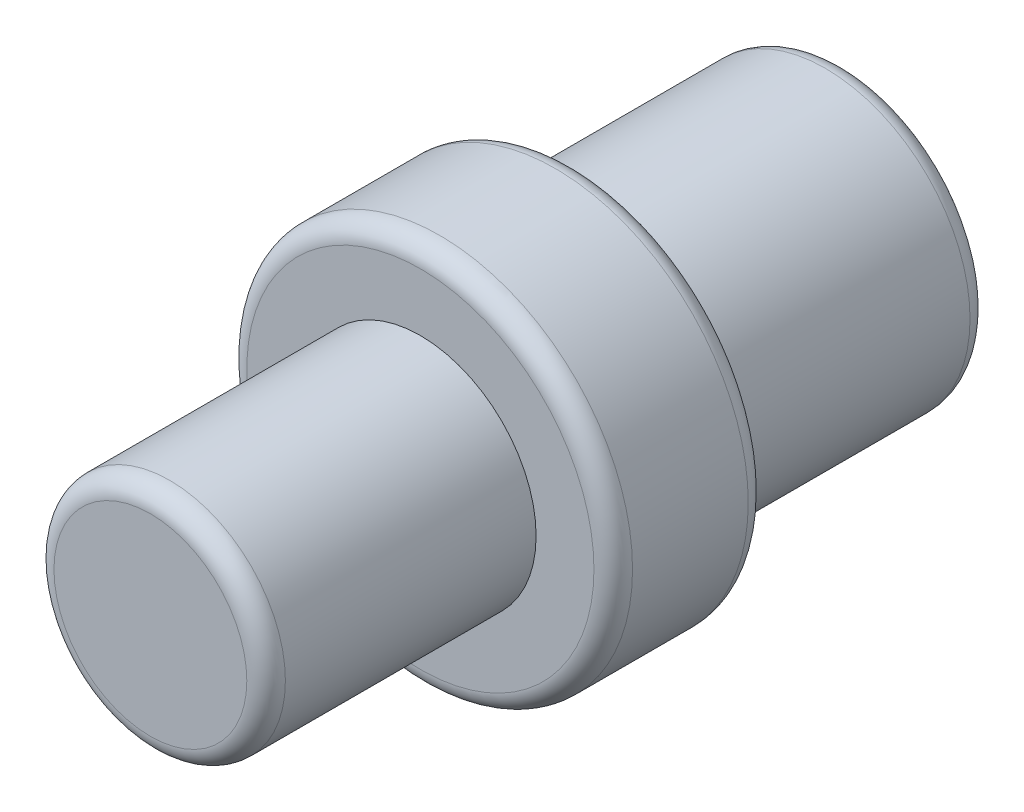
ISO-10303-21;
HEADER;
FILE_DESCRIPTION(('STEP AP214'),'2;1');
FILE_NAME('part.step','',(''),(''),'','','');
FILE_SCHEMA(('AUTOMOTIVE_DESIGN { 1 0 10303 214 1 1 1 1 }'));
ENDSEC;
DATA;
#1=APPLICATION_CONTEXT('core data for automotive mechanical design processes');
#2=APPLICATION_PROTOCOL_DEFINITION('international standard','automotive_design',2000,#1);
#3=PRODUCT_CONTEXT('',#1,'mechanical');
#4=PRODUCT('Part','Part','',(#3));
#5=PRODUCT_RELATED_PRODUCT_CATEGORY('part','',(#4));
#6=PRODUCT_DEFINITION_FORMATION('','',#4);
#7=PRODUCT_DEFINITION_CONTEXT('part definition',#1,'design');
#8=PRODUCT_DEFINITION('design','',#6,#7);
#9=PRODUCT_DEFINITION_SHAPE('','',#8);
#10=(LENGTH_UNIT() NAMED_UNIT(*) SI_UNIT(.MILLI.,.METRE.));
#11=(NAMED_UNIT(*) PLANE_ANGLE_UNIT() SI_UNIT($,.RADIAN.));
#12=(NAMED_UNIT(*) SI_UNIT($,.STERADIAN.) SOLID_ANGLE_UNIT());
#13=UNCERTAINTY_MEASURE_WITH_UNIT(LENGTH_MEASURE(1.E-05),#10,'distance_accuracy_value','');
#14=(GEOMETRIC_REPRESENTATION_CONTEXT(3) GLOBAL_UNCERTAINTY_ASSIGNED_CONTEXT((#13)) GLOBAL_UNIT_ASSIGNED_CONTEXT((#10,
#11,#12)) REPRESENTATION_CONTEXT('',''));
#15=CARTESIAN_POINT('',(0.,0.,0.));
#16=DIRECTION('',(0.,0.,1.));
#17=DIRECTION('',(1.,0.,0.));
#18=AXIS2_PLACEMENT_3D('',#15,#16,#17);
#19=CARTESIAN_POINT('',(0.,0.,0.));
#20=DIRECTION('',(0.,0.,1.));
#21=DIRECTION('',(1.,0.,0.));
#22=AXIS2_PLACEMENT_3D('',#19,#20,#21);
#23=PLANE('',#22);
#24=CARTESIAN_POINT('',(0.,0.,0.));
#25=DIRECTION('',(0.,0.,1.));
#26=DIRECTION('',(1.,0.,0.));
#27=AXIS2_PLACEMENT_3D('',#24,#25,#26);
#28=CIRCLE('',#27,4.5);
#29=CARTESIAN_POINT('',(4.5,0.,0.));
#30=VERTEX_POINT('',#29);
#31=EDGE_CURVE('E166',#30,#30,#28,.F.);
#32=ORIENTED_EDGE('',*,*,#31,.T.);
#33=EDGE_LOOP('',(#32));
#34=FACE_BOUND('',#33,.T.);
#35=CARTESIAN_POINT('',(0.,0.,0.));
#36=DIRECTION('',(0.,0.,1.));
#37=DIRECTION('',(1.,0.,0.));
#38=AXIS2_PLACEMENT_3D('',#35,#36,#37);
#39=CIRCLE('',#38,3.75);
#40=CARTESIAN_POINT('',(3.75,0.,0.));
#41=VERTEX_POINT('',#40);
#42=EDGE_CURVE('E187',#41,#41,#39,.F.);
#43=ORIENTED_EDGE('',*,*,#42,.F.);
#44=EDGE_LOOP('',(#43));
#45=FACE_BOUND('',#44,.T.);
#46=ADVANCED_FACE('F155',(#34,#45),#23,.F.);
#47=CARTESIAN_POINT('',(0.,0.,4.));
#48=DIRECTION('',(0.,0.,1.));
#49=DIRECTION('',(1.,0.,0.));
#50=AXIS2_PLACEMENT_3D('',#47,#48,#49);
#51=PLANE('',#50);
#52=CARTESIAN_POINT('',(0.,0.,4.));
#53=DIRECTION('',(0.,0.,1.));
#54=DIRECTION('',(1.,0.,0.));
#55=AXIS2_PLACEMENT_3D('',#52,#53,#54);
#56=CIRCLE('',#55,4.5);
#57=CARTESIAN_POINT('',(4.5,0.,4.));
#58=VERTEX_POINT('',#57);
#59=EDGE_CURVE('E178',#58,#58,#56,.T.);
#60=ORIENTED_EDGE('',*,*,#59,.T.);
#61=EDGE_LOOP('',(#60));
#62=FACE_BOUND('',#61,.T.);
#63=CARTESIAN_POINT('',(0.,0.,4.));
#64=DIRECTION('',(0.,0.,1.));
#65=DIRECTION('',(1.,0.,0.));
#66=AXIS2_PLACEMENT_3D('',#63,#64,#65);
#67=CIRCLE('',#66,3.);
#68=CARTESIAN_POINT('',(3.,0.,4.));
#69=VERTEX_POINT('',#68);
#70=EDGE_CURVE('E190',#69,#69,#67,.T.);
#71=ORIENTED_EDGE('',*,*,#70,.F.);
#72=EDGE_LOOP('',(#71));
#73=FACE_BOUND('',#72,.T.);
#74=ADVANCED_FACE('F196',(#62,#73),#51,.T.);
#75=CARTESIAN_POINT('',(0.,0.,4.));
#76=DIRECTION('',(0.,0.,-1.));
#77=DIRECTION('',(-1.,0.,0.));
#78=AXIS2_PLACEMENT_3D('',#75,#76,#77);
#79=CYLINDRICAL_SURFACE('',#78,5.);
#80=CARTESIAN_POINT('',(0.,0.,3.5));
#81=DIRECTION('',(0.,0.,1.));
#82=DIRECTION('',(1.,0.,0.));
#83=AXIS2_PLACEMENT_3D('',#80,#81,#82);
#84=CIRCLE('',#83,5.);
#85=CARTESIAN_POINT('',(5.,0.,3.5));
#86=VERTEX_POINT('',#85);
#87=EDGE_CURVE('E170',#86,#86,#84,.F.);
#88=ORIENTED_EDGE('',*,*,#87,.T.);
#89=EDGE_LOOP('',(#88));
#90=FACE_BOUND('',#89,.T.);
#91=CARTESIAN_POINT('',(0.,0.,0.5));
#92=DIRECTION('',(0.,0.,1.));
#93=DIRECTION('',(1.,0.,0.));
#94=AXIS2_PLACEMENT_3D('',#91,#92,#93);
#95=CIRCLE('',#94,5.);
#96=CARTESIAN_POINT('',(5.,0.,0.5));
#97=VERTEX_POINT('',#96);
#98=EDGE_CURVE('E175',#97,#97,#95,.T.);
#99=ORIENTED_EDGE('',*,*,#98,.T.);
#100=EDGE_LOOP('',(#99));
#101=FACE_BOUND('',#100,.T.);
#102=ADVANCED_FACE('F157',(#90,#101),#79,.T.);
#103=CARTESIAN_POINT('',(0.,0.,11.));
#104=DIRECTION('',(0.,0.,-1.));
#105=DIRECTION('',(-1.,0.,0.));
#106=AXIS2_PLACEMENT_3D('',#103,#104,#105);
#107=CYLINDRICAL_SURFACE('',#106,3.);
#108=CARTESIAN_POINT('',(0.,0.,10.5));
#109=DIRECTION('',(0.,0.,1.));
#110=DIRECTION('',(1.,0.,0.));
#111=AXIS2_PLACEMENT_3D('',#108,#109,#110);
#112=CIRCLE('',#111,3.);
#113=CARTESIAN_POINT('',(3.,0.,10.5));
#114=VERTEX_POINT('',#113);
#115=EDGE_CURVE('E181',#114,#114,#112,.F.);
#116=ORIENTED_EDGE('',*,*,#115,.T.);
#117=EDGE_LOOP('',(#116));
#118=FACE_BOUND('',#117,.T.);
#119=ORIENTED_EDGE('',*,*,#70,.T.);
#120=EDGE_LOOP('',(#119));
#121=FACE_BOUND('',#120,.T.);
#122=ADVANCED_FACE('F194',(#118,#121),#107,.T.);
#123=CARTESIAN_POINT('',(0.,0.,11.));
#124=DIRECTION('',(0.,0.,1.));
#125=DIRECTION('',(1.,0.,0.));
#126=AXIS2_PLACEMENT_3D('',#123,#124,#125);
#127=PLANE('',#126);
#128=CARTESIAN_POINT('',(0.,0.,11.));
#129=DIRECTION('',(0.,0.,1.));
#130=DIRECTION('',(1.,0.,0.));
#131=AXIS2_PLACEMENT_3D('',#128,#129,#130);
#132=CIRCLE('',#131,2.5);
#133=CARTESIAN_POINT('',(2.5,0.,11.));
#134=VERTEX_POINT('',#133);
#135=EDGE_CURVE('E184',#134,#134,#132,.T.);
#136=ORIENTED_EDGE('',*,*,#135,.T.);
#137=EDGE_LOOP('',(#136));
#138=FACE_BOUND('',#137,.T.);
#139=ADVANCED_FACE('F209',(#138),#127,.T.);
#140=CARTESIAN_POINT('',(0.,0.,-7.));
#141=DIRECTION('',(0.,0.,1.));
#142=DIRECTION('',(1.,0.,0.));
#143=AXIS2_PLACEMENT_3D('',#140,#141,#142);
#144=CYLINDRICAL_SURFACE('',#143,3.75);
#145=CARTESIAN_POINT('',(0.,0.,-6.5));
#146=DIRECTION('',(0.,0.,-1.));
#147=DIRECTION('',(-1.,0.,0.));
#148=AXIS2_PLACEMENT_3D('',#145,#146,#147);
#149=CIRCLE('',#148,3.75);
#150=CARTESIAN_POINT('',(-3.75,0.,-6.5));
#151=VERTEX_POINT('',#150);
#152=EDGE_CURVE('E11',#151,#151,#149,.F.);
#153=ORIENTED_EDGE('',*,*,#152,.T.);
#154=EDGE_LOOP('',(#153));
#155=FACE_BOUND('',#154,.T.);
#156=ORIENTED_EDGE('',*,*,#42,.T.);
#157=EDGE_LOOP('',(#156));
#158=FACE_BOUND('',#157,.T.);
#159=ADVANCED_FACE('F213',(#155,#158),#144,.T.);
#160=CARTESIAN_POINT('',(0.,0.,-7.));
#161=DIRECTION('',(0.,0.,-1.));
#162=DIRECTION('',(-1.,0.,0.));
#163=AXIS2_PLACEMENT_3D('',#160,#161,#162);
#164=PLANE('',#163);
#165=CARTESIAN_POINT('',(0.,0.,-7.));
#166=DIRECTION('',(0.,0.,-1.));
#167=DIRECTION('',(-1.,0.,0.));
#168=AXIS2_PLACEMENT_3D('',#165,#166,#167);
#169=CIRCLE('',#168,3.25);
#170=CARTESIAN_POINT('',(-3.25,0.,-7.));
#171=VERTEX_POINT('',#170);
#172=EDGE_CURVE('E162',#171,#171,#169,.T.);
#173=ORIENTED_EDGE('',*,*,#172,.T.);
#174=EDGE_LOOP('',(#173));
#175=FACE_BOUND('',#174,.T.);
#176=ADVANCED_FACE('F217',(#175),#164,.T.);
#177=CARTESIAN_POINT('',(0.,0.,10.5));
#178=DIRECTION('',(0.,0.,1.));
#179=DIRECTION('',(1.,0.,0.));
#180=AXIS2_PLACEMENT_3D('',#177,#178,#179);
#181=TOROIDAL_SURFACE('',#180,2.5,0.5);
#182=ORIENTED_EDGE('',*,*,#115,.F.);
#183=EDGE_LOOP('',(#182));
#184=FACE_BOUND('',#183,.T.);
#185=ORIENTED_EDGE('',*,*,#135,.F.);
#186=EDGE_LOOP('',(#185));
#187=FACE_BOUND('',#186,.T.);
#188=ADVANCED_FACE('F220',(#184,#187),#181,.T.);
#189=CARTESIAN_POINT('',(0.,0.,3.5));
#190=DIRECTION('',(0.,0.,1.));
#191=DIRECTION('',(1.,0.,0.));
#192=AXIS2_PLACEMENT_3D('',#189,#190,#191);
#193=TOROIDAL_SURFACE('',#192,4.5,0.5);
#194=ORIENTED_EDGE('',*,*,#87,.F.);
#195=EDGE_LOOP('',(#194));
#196=FACE_BOUND('',#195,.T.);
#197=ORIENTED_EDGE('',*,*,#59,.F.);
#198=EDGE_LOOP('',(#197));
#199=FACE_BOUND('',#198,.T.);
#200=ADVANCED_FACE('F223',(#196,#199),#193,.T.);
#201=CARTESIAN_POINT('',(0.,0.,0.5));
#202=DIRECTION('',(0.,0.,1.));
#203=DIRECTION('',(1.,0.,0.));
#204=AXIS2_PLACEMENT_3D('',#201,#202,#203);
#205=TOROIDAL_SURFACE('',#204,4.5,0.5);
#206=ORIENTED_EDGE('',*,*,#31,.F.);
#207=EDGE_LOOP('',(#206));
#208=FACE_BOUND('',#207,.T.);
#209=ORIENTED_EDGE('',*,*,#98,.F.);
#210=EDGE_LOOP('',(#209));
#211=FACE_BOUND('',#210,.T.);
#212=ADVANCED_FACE('F227',(#208,#211),#205,.T.);
#213=CARTESIAN_POINT('',(0.,0.,-6.5));
#214=DIRECTION('',(0.,0.,-1.));
#215=DIRECTION('',(-1.,0.,0.));
#216=AXIS2_PLACEMENT_3D('',#213,#214,#215);
#217=TOROIDAL_SURFACE('',#216,3.25,0.5);
#218=ORIENTED_EDGE('',*,*,#152,.F.);
#219=EDGE_LOOP('',(#218));
#220=FACE_BOUND('',#219,.T.);
#221=ORIENTED_EDGE('',*,*,#172,.F.);
#222=EDGE_LOOP('',(#221));
#223=FACE_BOUND('',#222,.T.);
#224=ADVANCED_FACE('F231',(#220,#223),#217,.T.);
#225=CLOSED_SHELL('',(#46,#74,#102,#122,#139,#159,#176,#188,#200,#212,#224));
#226=MANIFOLD_SOLID_BREP('B2',#225);
#227=ADVANCED_BREP_SHAPE_REPRESENTATION('',(#18,#226),#14);
#228=SHAPE_DEFINITION_REPRESENTATION(#9,#227);
ENDSEC;
END-ISO-10303-21;
